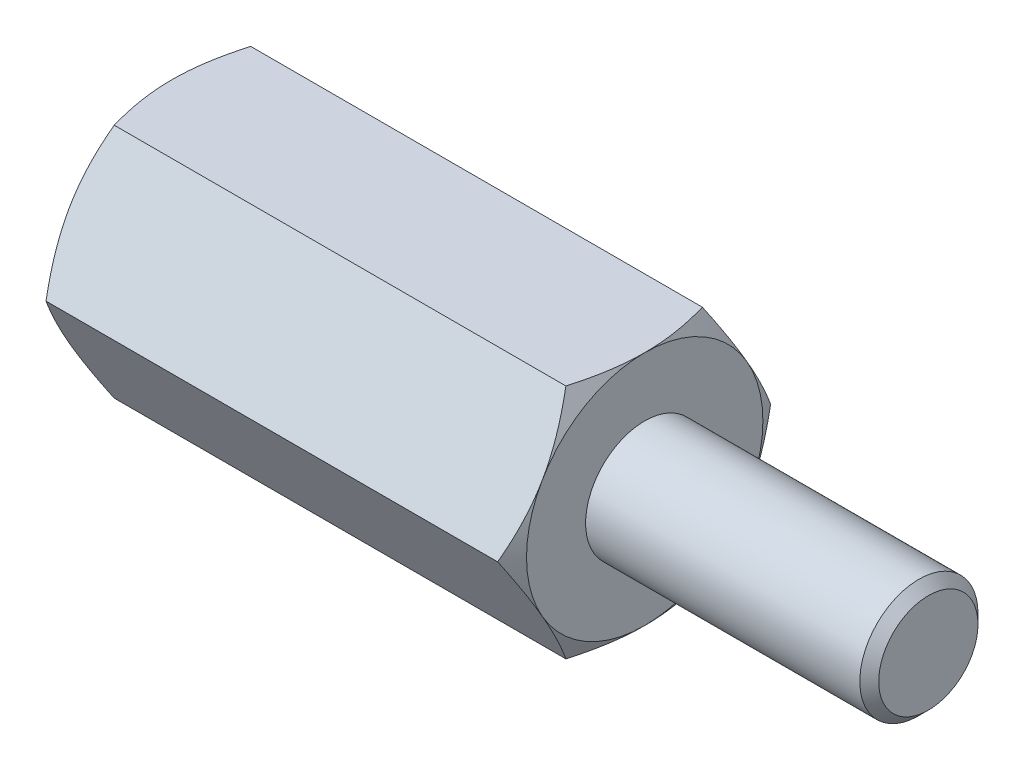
from build123d import *

# Parameters (mm, degrees)
EXTRUDE2_DEPTH = 5
SKETCH3_R      = 1.05
EXTRUDE3_DEPTH = 5
SKETCH5_R      = 1.25
EXTRUDE4_DEPTH = 6
CHAMFER1_SIZE  = 0.2


with BuildPart() as part:
    # Sketch1 → Extrude2 (new, symmetric)
    with BuildSketch(Plane(origin=(0, 0, 0), x_dir=(0, 0, -1), z_dir=(1, 0, 0))):
        Polygon((1.443375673, 2.5), (-1.443375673, 2.5), (-2.886751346, 0), (-1.443375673, -2.5), (1.443375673, -2.5), (2.886751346, 0), align=None)
    extrude(amount=EXTRUDE2_DEPTH, both=True)

    # Sketch2 → Cut-Revolve1 (revolve, cut)
    with BuildSketch(Plane.XY):
        with BuildLine():
            Line((-5, 2.5), (-3.5, 5.098076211))
            ThreePointArc((-3.5, 5.098076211), (-3.98810136, 6.276457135), (-5, 5.5))
            Line((-5, 5.5), (-5, 2.5))
        make_face()
    cut_revolve1 = revolve(axis=Axis((0, 0, 0), (1, 0, 0)), mode=Mode.SUBTRACT)

    # Mirror1: Cut-Revolve1 across plane
    add(cut_revolve1.mirror(Plane(origin=(0, 0, 0), x_dir=(0, 0, 1), z_dir=(1, 0, 0))), mode=Mode.SUBTRACT)

    # Sketch3 → Extrude3 (cut)
    with BuildSketch(Plane.ZY.offset(5)):
        Circle(SKETCH3_R)
    extrude(amount=-EXTRUDE3_DEPTH, mode=Mode.SUBTRACT)

    # Sketch4 → Cut-Revolve2 (revolve, cut)
    with BuildSketch(Plane.XY, mode=Mode.PRIVATE) as cut_revolve2_sk:
        Polygon((0, 0), (0, 1.05), (0.606217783, 0), align=None)
    revolve(cut_revolve2_sk.sketch.rotate(Axis((0.606217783, 0, 0), (-1, 0, 0)), 270), axis=Axis((0.606217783, 0, 0), (-1, 0, 0)), mode=Mode.SUBTRACT)

    # Sketch5 → Extrude4 (add)
    with BuildSketch(Plane(origin=(5, 0, 0), x_dir=(0, 0, -1), z_dir=(1, 0, 0))):
        Circle(SKETCH5_R)
    extrude(amount=EXTRUDE4_DEPTH)

    # Chamfer1
    chamfer1_edges = [part.edges().sort_by_distance(p)[0] for p in [
        (11, 0, 1.25),
    ]]
    chamfer(chamfer1_edges, length=CHAMFER1_SIZE)


solid = part.part
